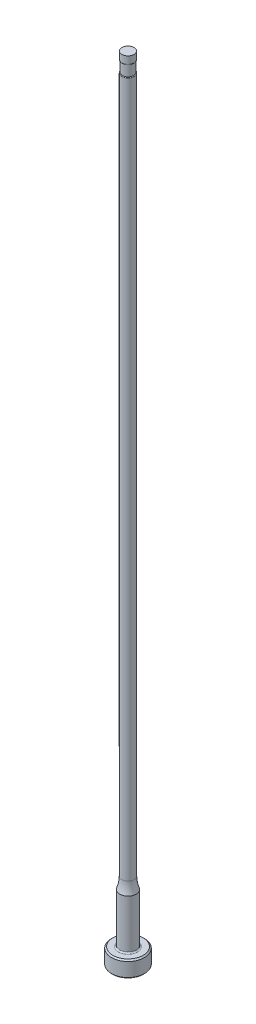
ISO-10303-21;
HEADER;
FILE_DESCRIPTION(('STEP AP214'),'2;1');
FILE_NAME('part.step','',(''),(''),'','','');
FILE_SCHEMA(('AUTOMOTIVE_DESIGN { 1 0 10303 214 1 1 1 1 }'));
ENDSEC;
DATA;
#1=APPLICATION_CONTEXT('core data for automotive mechanical design processes');
#2=APPLICATION_PROTOCOL_DEFINITION('international standard','automotive_design',2000,#1);
#3=PRODUCT_CONTEXT('',#1,'mechanical');
#4=PRODUCT('Part','Part','',(#3));
#5=PRODUCT_RELATED_PRODUCT_CATEGORY('part','',(#4));
#6=PRODUCT_DEFINITION_FORMATION('','',#4);
#7=PRODUCT_DEFINITION_CONTEXT('part definition',#1,'design');
#8=PRODUCT_DEFINITION('design','',#6,#7);
#9=PRODUCT_DEFINITION_SHAPE('','',#8);
#10=(LENGTH_UNIT() NAMED_UNIT(*) SI_UNIT(.MILLI.,.METRE.));
#11=(NAMED_UNIT(*) PLANE_ANGLE_UNIT() SI_UNIT($,.RADIAN.));
#12=(NAMED_UNIT(*) SI_UNIT($,.STERADIAN.) SOLID_ANGLE_UNIT());
#13=UNCERTAINTY_MEASURE_WITH_UNIT(LENGTH_MEASURE(1.E-05),#10,'distance_accuracy_value','');
#14=(GEOMETRIC_REPRESENTATION_CONTEXT(3) GLOBAL_UNCERTAINTY_ASSIGNED_CONTEXT((#13)) GLOBAL_UNIT_ASSIGNED_CONTEXT((#10,
#11,#12)) REPRESENTATION_CONTEXT('',''));
#15=CARTESIAN_POINT('',(0.,0.,0.));
#16=DIRECTION('',(0.,0.,1.));
#17=DIRECTION('',(1.,0.,0.));
#18=AXIS2_PLACEMENT_3D('',#15,#16,#17);
#19=CARTESIAN_POINT('',(0.,259.958771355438,0.));
#20=DIRECTION('',(0.,1.,0.));
#21=DIRECTION('',(0.,0.,1.));
#22=AXIS2_PLACEMENT_3D('',#19,#20,#21);
#23=CYLINDRICAL_SURFACE('',#22,1.18998999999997);
#24=DIRECTION('',(0.,1.,0.));
#25=VECTOR('',#24,1.);
#26=CARTESIAN_POINT('',(-1.08838999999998,259.958771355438,-0.481127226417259));
#27=LINE('',#26,#25);
#28=CARTESIAN_POINT('',(-1.08838999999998,148.719565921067,-0.481127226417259));
#29=VERTEX_POINT('',#28);
#30=CARTESIAN_POINT('',(-1.08838999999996,111.76,-0.481127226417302));
#31=VERTEX_POINT('',#30);
#32=EDGE_CURVE('E66',#29,#31,#27,.F.);
#33=ORIENTED_EDGE('',*,*,#32,.F.);
#34=CARTESIAN_POINT('',(0.,148.719565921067,0.));
#35=DIRECTION('',(0.,1.,0.));
#36=DIRECTION('',(0.,0.,1.));
#37=AXIS2_PLACEMENT_3D('',#34,#35,#36);
#38=CIRCLE('',#37,1.18998999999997);
#39=CARTESIAN_POINT('',(-1.08838999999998,148.719565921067,0.481127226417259));
#40=VERTEX_POINT('',#39);
#41=EDGE_CURVE('E44',#29,#40,#38,.F.);
#42=ORIENTED_EDGE('',*,*,#41,.T.);
#43=DIRECTION('',(0.,1.,0.));
#44=VECTOR('',#43,1.);
#45=CARTESIAN_POINT('',(-1.08838999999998,259.958771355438,0.481127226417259));
#46=LINE('',#45,#44);
#47=CARTESIAN_POINT('',(-1.08838999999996,111.76,0.481127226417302));
#48=VERTEX_POINT('',#47);
#49=EDGE_CURVE('E72',#48,#40,#46,.T.);
#50=ORIENTED_EDGE('',*,*,#49,.F.);
#51=CARTESIAN_POINT('',(-1.08838999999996,111.76,-0.481127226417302));
#52=CARTESIAN_POINT('',(-1.08838966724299,111.731183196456,-0.481120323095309));
#53=CARTESIAN_POINT('',(-1.08878297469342,111.702379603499,-0.480240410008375));
#54=CARTESIAN_POINT('',(-1.0903471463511,111.64487486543,-0.476680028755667));
#55=CARTESIAN_POINT('',(-1.09151883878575,111.616173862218,-0.473997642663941));
#56=CARTESIAN_POINT('',(-1.0962236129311,111.529732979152,-0.463079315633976));
#57=CARTESIAN_POINT('',(-1.10094613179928,111.472365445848,-0.451969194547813));
#58=CARTESIAN_POINT('',(-1.11171709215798,111.373397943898,-0.424640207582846));
#59=CARTESIAN_POINT('',(-1.11720060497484,111.331237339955,-0.41021369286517));
#60=CARTESIAN_POINT('',(-1.12939077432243,111.24975729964,-0.375363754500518));
#61=CARTESIAN_POINT('',(-1.13609165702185,111.21042562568,-0.354968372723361));
#62=CARTESIAN_POINT('',(-1.1472645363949,111.150969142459,-0.316366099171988));
#63=CARTESIAN_POINT('',(-1.15158336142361,111.129348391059,-0.300422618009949));
#64=CARTESIAN_POINT('',(-1.16012072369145,111.088602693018,-0.265553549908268));
#65=CARTESIAN_POINT('',(-1.16433935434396,111.069475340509,-0.246630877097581));
#66=CARTESIAN_POINT('',(-1.17139417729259,111.038625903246,-0.210179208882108));
#67=CARTESIAN_POINT('',(-1.17432972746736,111.026201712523,-0.193268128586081));
#68=CARTESIAN_POINT('',(-1.17964378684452,111.004180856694,-0.157607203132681));
#69=CARTESIAN_POINT('',(-1.18202305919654,110.994580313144,-0.138859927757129));
#70=CARTESIAN_POINT('',(-1.1856222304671,110.980246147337,-0.103155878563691));
#71=CARTESIAN_POINT('',(-1.1869702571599,110.974963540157,-0.0864338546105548));
#72=CARTESIAN_POINT('',(-1.18896221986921,110.967197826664,-0.05230931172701));
#73=CARTESIAN_POINT('',(-1.18960661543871,110.964712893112,-0.0349072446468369));
#74=CARTESIAN_POINT('',(-1.1901191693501,110.962734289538,0.000122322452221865));
#75=CARTESIAN_POINT('',(-1.18998545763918,110.963247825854,0.0177502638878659));
#76=CARTESIAN_POINT('',(-1.18895328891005,110.967240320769,0.0526432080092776));
#77=CARTESIAN_POINT('',(-1.18805460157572,110.970720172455,0.0699080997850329));
#78=CARTESIAN_POINT('',(-1.18562828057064,110.98023683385,0.103108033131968));
#79=CARTESIAN_POINT('',(-1.18411982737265,110.986195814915,0.11906720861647));
#80=CARTESIAN_POINT('',(-1.18061056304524,111.000296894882,0.149921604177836));
#81=CARTESIAN_POINT('',(-1.17860955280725,111.008439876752,0.164816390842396));
#82=CARTESIAN_POINT('',(-1.17313921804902,111.031184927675,0.200749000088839));
#83=CARTESIAN_POINT('',(-1.1694436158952,111.046956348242,0.221012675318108));
#84=CARTESIAN_POINT('',(-1.16168543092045,111.081494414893,0.258718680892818));
#85=CARTESIAN_POINT('',(-1.15762196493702,111.100268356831,0.276153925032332));
#86=CARTESIAN_POINT('',(-1.14734460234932,111.150227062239,0.316729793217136));
#87=CARTESIAN_POINT('',(-1.14110751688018,111.182801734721,0.338145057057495));
#88=CARTESIAN_POINT('',(-1.12927494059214,111.250924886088,0.375765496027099));
#89=CARTESIAN_POINT('',(-1.12368108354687,111.28648055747,0.391957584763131));
#90=CARTESIAN_POINT('',(-1.11078204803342,111.379330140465,0.427525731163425));
#91=CARTESIAN_POINT('',(-1.10420802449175,111.437901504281,0.443819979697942));
#92=CARTESIAN_POINT('',(-1.09432365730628,111.556957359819,0.467642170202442));
#93=CARTESIAN_POINT('',(-1.09101219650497,111.617441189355,0.475173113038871));
#94=CARTESIAN_POINT('',(-1.0890934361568,111.691778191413,0.479532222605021));
#95=CARTESIAN_POINT('',(-1.08882945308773,111.705431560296,0.480131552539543));
#96=CARTESIAN_POINT('',(-1.08847803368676,111.732722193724,0.480928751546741));
#97=CARTESIAN_POINT('',(-1.08839020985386,111.746359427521,0.481127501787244));
#98=CARTESIAN_POINT('',(-1.08838999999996,111.76,0.481127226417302));
#99=B_SPLINE_CURVE_WITH_KNOTS('',3,(#51,#52,#53,#54,#55,#56,#57,#58,#59,#60,#61,#62,#63,#64,#65,
#66,#67,#68,#69,#70,#71,#72,#73,#74,#75,#76,#77,#78,#79,#80,#81,#82,#83,#84,#85,#86,#87,#88,#89,
#90,#91,#92,#93,#94,#95,#96,#97,#98),.UNSPECIFIED.,.F.,.F.,(4,2,2,2,2,2,2,2,2,2,2,2,2,2,2,2,2,2,
2,2,2,2,2,4),(0.,0.0864065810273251,0.172905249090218,0.348016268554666,0.48234589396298,
0.616054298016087,0.697472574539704,0.778811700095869,0.842154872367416,0.905410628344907,
0.957949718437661,1.01045447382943,1.0630854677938,1.11573231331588,1.16683808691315,
1.21796455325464,1.29535063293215,1.37292769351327,1.49070506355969,1.60877526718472,
1.79125586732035,1.9736739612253,2.01467753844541,2.05559081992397),.UNSPECIFIED.);
#100=EDGE_CURVE('E74',#31,#48,#99,.T.);
#101=ORIENTED_EDGE('',*,*,#100,.F.);
#102=EDGE_LOOP('',(#33,#42,#50,#101));
#103=FACE_BOUND('',#102,.T.);
#104=CARTESIAN_POINT('',(0.,14.9114164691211,0.));
#105=DIRECTION('',(0.,1.,0.));
#106=DIRECTION('',(0.,0.,1.));
#107=AXIS2_PLACEMENT_3D('',#104,#105,#106);
#108=CIRCLE('',#107,1.18998999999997);
#109=CARTESIAN_POINT('',(0.,14.9114164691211,1.18998999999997));
#110=VERTEX_POINT('',#109);
#111=EDGE_CURVE('E95',#110,#110,#108,.T.);
#112=ORIENTED_EDGE('',*,*,#111,.T.);
#113=EDGE_LOOP('',(#112));
#114=FACE_BOUND('',#113,.T.);
#115=ADVANCED_FACE('F36',(#103,#114),#23,.T.);
#116=CARTESIAN_POINT('',(0.,14.9114164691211,0.));
#117=DIRECTION('',(0.,1.,0.));
#118=DIRECTION('',(0.,0.,1.));
#119=AXIS2_PLACEMENT_3D('',#116,#117,#118);
#120=TOROIDAL_SURFACE('',#119,7.53998999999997,6.35);
#121=CARTESIAN_POINT('',(0.,12.7,0.));
#122=DIRECTION('',(0.,1.,0.));
#123=DIRECTION('',(0.,0.,1.));
#124=AXIS2_PLACEMENT_3D('',#121,#122,#123);
#125=CIRCLE('',#124,1.58749999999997);
#126=CARTESIAN_POINT('',(0.,12.7,1.58749999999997));
#127=VERTEX_POINT('',#126);
#128=EDGE_CURVE('E92',#127,#127,#125,.T.);
#129=ORIENTED_EDGE('',*,*,#128,.T.);
#130=EDGE_LOOP('',(#129));
#131=FACE_BOUND('',#130,.T.);
#132=ORIENTED_EDGE('',*,*,#111,.F.);
#133=EDGE_LOOP('',(#132));
#134=FACE_BOUND('',#133,.T.);
#135=ADVANCED_FACE('F156',(#131,#134),#120,.F.);
#136=CARTESIAN_POINT('',(0.,259.958771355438,0.));
#137=DIRECTION('',(0.,1.,0.));
#138=DIRECTION('',(0.,0.,1.));
#139=AXIS2_PLACEMENT_3D('',#136,#137,#138);
#140=CYLINDRICAL_SURFACE('',#139,1.58749999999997);
#141=CARTESIAN_POINT('',(0.,3.42900000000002,0.));
#142=DIRECTION('',(0.,1.,0.));
#143=DIRECTION('',(0.,0.,1.));
#144=AXIS2_PLACEMENT_3D('',#141,#142,#143);
#145=CIRCLE('',#144,1.58749999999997);
#146=CARTESIAN_POINT('',(0.,3.42900000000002,1.58749999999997));
#147=VERTEX_POINT('',#146);
#148=EDGE_CURVE('E110',#147,#147,#145,.T.);
#149=ORIENTED_EDGE('',*,*,#148,.T.);
#150=EDGE_LOOP('',(#149));
#151=FACE_BOUND('',#150,.T.);
#152=ORIENTED_EDGE('',*,*,#128,.F.);
#153=EDGE_LOOP('',(#152));
#154=FACE_BOUND('',#153,.T.);
#155=ADVANCED_FACE('F153',(#151,#154),#140,.T.);
#156=CARTESIAN_POINT('',(-3.17499999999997,3.175,0.));
#157=DIRECTION('',(0.,1.,0.));
#158=DIRECTION('',(0.,0.,1.));
#159=AXIS2_PLACEMENT_3D('',#156,#157,#158);
#160=PLANE('',#159);
#161=CARTESIAN_POINT('',(0.,3.175,0.));
#162=DIRECTION('',(0.,1.,0.));
#163=DIRECTION('',(0.,0.,1.));
#164=AXIS2_PLACEMENT_3D('',#161,#162,#163);
#165=CIRCLE('',#164,1.84149999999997);
#166=CARTESIAN_POINT('',(0.,3.175,1.84149999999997));
#167=VERTEX_POINT('',#166);
#168=EDGE_CURVE('E78',#167,#167,#165,.F.);
#169=ORIENTED_EDGE('',*,*,#168,.T.);
#170=EDGE_LOOP('',(#169));
#171=FACE_BOUND('',#170,.T.);
#172=CARTESIAN_POINT('',(0.,3.175,0.));
#173=DIRECTION('',(0.,1.,0.));
#174=DIRECTION('',(0.,0.,1.));
#175=AXIS2_PLACEMENT_3D('',#172,#173,#174);
#176=CIRCLE('',#175,2.92099999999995);
#177=CARTESIAN_POINT('',(0.,3.175,2.92099999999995));
#178=VERTEX_POINT('',#177);
#179=EDGE_CURVE('E98',#178,#178,#176,.T.);
#180=ORIENTED_EDGE('',*,*,#179,.T.);
#181=EDGE_LOOP('',(#180));
#182=FACE_BOUND('',#181,.T.);
#183=ADVANCED_FACE('F149',(#171,#182),#160,.T.);
#184=CARTESIAN_POINT('',(0.,259.958771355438,0.));
#185=DIRECTION('',(0.,1.,0.));
#186=DIRECTION('',(0.,0.,1.));
#187=AXIS2_PLACEMENT_3D('',#184,#185,#186);
#188=CYLINDRICAL_SURFACE('',#187,3.17499999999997);
#189=CARTESIAN_POINT('',(0.,2.92100000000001,0.));
#190=DIRECTION('',(0.,1.,0.));
#191=DIRECTION('',(0.,0.,1.));
#192=AXIS2_PLACEMENT_3D('',#189,#190,#191);
#193=CIRCLE('',#192,3.17499999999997);
#194=CARTESIAN_POINT('',(0.,2.92100000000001,3.17499999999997));
#195=VERTEX_POINT('',#194);
#196=EDGE_CURVE('E104',#195,#195,#193,.F.);
#197=ORIENTED_EDGE('',*,*,#196,.T.);
#198=EDGE_LOOP('',(#197));
#199=FACE_BOUND('',#198,.T.);
#200=CARTESIAN_POINT('',(0.,0.254000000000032,0.));
#201=DIRECTION('',(0.,-1.,0.));
#202=DIRECTION('',(0.,0.,-1.));
#203=AXIS2_PLACEMENT_3D('',#200,#201,#202);
#204=CIRCLE('',#203,3.17499999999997);
#205=CARTESIAN_POINT('',(0.,0.254000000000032,-3.17499999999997));
#206=VERTEX_POINT('',#205);
#207=EDGE_CURVE('E101',#206,#206,#204,.F.);
#208=ORIENTED_EDGE('',*,*,#207,.T.);
#209=EDGE_LOOP('',(#208));
#210=FACE_BOUND('',#209,.T.);
#211=ADVANCED_FACE('F145',(#199,#210),#188,.T.);
#212=CARTESIAN_POINT('',(0.,0.,0.));
#213=DIRECTION('',(0.,-1.,0.));
#214=DIRECTION('',(0.,0.,-1.));
#215=AXIS2_PLACEMENT_3D('',#212,#213,#214);
#216=PLANE('',#215);
#217=CARTESIAN_POINT('',(0.,0.,0.));
#218=DIRECTION('',(0.,-1.,0.));
#219=DIRECTION('',(0.,0.,-1.));
#220=AXIS2_PLACEMENT_3D('',#217,#218,#219);
#221=CIRCLE('',#220,2.92099999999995);
#222=CARTESIAN_POINT('',(0.,0.,-2.92099999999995));
#223=VERTEX_POINT('',#222);
#224=EDGE_CURVE('E107',#223,#223,#221,.T.);
#225=ORIENTED_EDGE('',*,*,#224,.T.);
#226=EDGE_LOOP('',(#225));
#227=FACE_BOUND('',#226,.T.);
#228=ADVANCED_FACE('F141',(#227),#216,.T.);
#229=CARTESIAN_POINT('',(0.,3.17499999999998,0.));
#230=DIRECTION('',(0.,-1.,0.));
#231=DIRECTION('',(0.,0.,-1.));
#232=AXIS2_PLACEMENT_3D('',#229,#230,#231);
#233=CONICAL_SURFACE('',#232,2.92099999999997,0.7853981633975);
#234=ORIENTED_EDGE('',*,*,#196,.F.);
#235=EDGE_LOOP('',(#234));
#236=FACE_BOUND('',#235,.T.);
#237=ORIENTED_EDGE('',*,*,#179,.F.);
#238=EDGE_LOOP('',(#237));
#239=FACE_BOUND('',#238,.T.);
#240=ADVANCED_FACE('F144',(#236,#239),#233,.T.);
#241=CARTESIAN_POINT('',(0.,0.254000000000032,0.));
#242=DIRECTION('',(0.,1.,0.));
#243=DIRECTION('',(0.,0.,1.));
#244=AXIS2_PLACEMENT_3D('',#241,#242,#243);
#245=CONICAL_SURFACE('',#244,3.17499999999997,0.785398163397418);
#246=ORIENTED_EDGE('',*,*,#224,.F.);
#247=EDGE_LOOP('',(#246));
#248=FACE_BOUND('',#247,.T.);
#249=ORIENTED_EDGE('',*,*,#207,.F.);
#250=EDGE_LOOP('',(#249));
#251=FACE_BOUND('',#250,.T.);
#252=ADVANCED_FACE('F245',(#248,#251),#245,.T.);
#253=CARTESIAN_POINT('',(0.,3.42900000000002,0.));
#254=DIRECTION('',(0.,1.,0.));
#255=DIRECTION('',(0.,0.,1.));
#256=AXIS2_PLACEMENT_3D('',#253,#254,#255);
#257=TOROIDAL_SURFACE('',#256,1.84149999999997,0.254);
#258=ORIENTED_EDGE('',*,*,#168,.F.);
#259=EDGE_LOOP('',(#258));
#260=FACE_BOUND('',#259,.T.);
#261=ORIENTED_EDGE('',*,*,#148,.F.);
#262=EDGE_LOOP('',(#261));
#263=FACE_BOUND('',#262,.T.);
#264=ADVANCED_FACE('F139',(#260,#263),#257,.F.);
#265=CARTESIAN_POINT('',(0.,153.448281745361,0.));
#266=DIRECTION('',(0.,1.,0.));
#267=DIRECTION('',(0.,0.,1.));
#268=AXIS2_PLACEMENT_3D('',#265,#266,#267);
#269=CYLINDRICAL_SURFACE('',#268,1.08838999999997);
#270=CARTESIAN_POINT('',(0.,150.876,0.));
#271=DIRECTION('',(0.,1.,0.));
#272=DIRECTION('',(0.,0.,1.));
#273=AXIS2_PLACEMENT_3D('',#270,#271,#272);
#274=CIRCLE('',#273,1.08838999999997);
#275=CARTESIAN_POINT('',(0.,150.876,1.08838999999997));
#276=VERTEX_POINT('',#275);
#277=EDGE_CURVE('E71',#276,#276,#274,.T.);
#278=ORIENTED_EDGE('',*,*,#277,.F.);
#279=EDGE_LOOP('',(#278));
#280=FACE_BOUND('',#279,.T.);
#281=CARTESIAN_POINT('',(0.,148.844,0.));
#282=DIRECTION('',(0.,1.,0.));
#283=DIRECTION('',(0.,0.,1.));
#284=AXIS2_PLACEMENT_3D('',#281,#282,#283);
#285=CIRCLE('',#284,1.08838999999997);
#286=CARTESIAN_POINT('',(-1.08838999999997,148.844,0.));
#287=VERTEX_POINT('',#286);
#288=EDGE_CURVE('E89',#287,#287,#285,.T.);
#289=ORIENTED_EDGE('',*,*,#288,.T.);
#290=EDGE_LOOP('',(#289));
#291=FACE_BOUND('',#290,.T.);
#292=ADVANCED_FACE('F136',(#280,#291),#269,.T.);
#293=CARTESIAN_POINT('',(-1.08838999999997,149.86,-3.17499999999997));
#294=DIRECTION('',(1.,0.,0.));
#295=DIRECTION('',(0.,1.,0.));
#296=AXIS2_PLACEMENT_3D('',#293,#294,#295);
#297=PLANE('',#296);
#298=CARTESIAN_POINT('',(-1.08838999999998,148.719565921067,0.481127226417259));
#299=CARTESIAN_POINT('',(-1.08838999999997,148.722730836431,0.481135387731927));
#300=CARTESIAN_POINT('',(-1.08838999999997,148.725885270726,0.480835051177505));
#301=CARTESIAN_POINT('',(-1.08838999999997,148.73205903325,0.479692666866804));
#302=CARTESIAN_POINT('',(-1.08838999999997,148.735079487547,0.478856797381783));
#303=CARTESIAN_POINT('',(-1.08838999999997,148.741599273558,0.476477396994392));
#304=CARTESIAN_POINT('',(-1.08838999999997,148.745055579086,0.474817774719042));
#305=CARTESIAN_POINT('',(-1.08838999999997,148.75166384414,0.470958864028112));
#306=CARTESIAN_POINT('',(-1.08838999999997,148.754814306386,0.468757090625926));
#307=CARTESIAN_POINT('',(-1.08838999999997,148.762477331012,0.462614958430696));
#308=CARTESIAN_POINT('',(-1.08838999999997,148.766761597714,0.45839250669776));
#309=CARTESIAN_POINT('',(-1.08838999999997,148.774655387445,0.449369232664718));
#310=CARTESIAN_POINT('',(-1.08838999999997,148.778263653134,0.444567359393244));
#311=CARTESIAN_POINT('',(-1.08838999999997,148.788137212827,0.429819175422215));
#312=CARTESIAN_POINT('',(-1.08838999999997,148.793627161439,0.419360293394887));
#313=CARTESIAN_POINT('',(-1.08838999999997,148.803180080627,0.397821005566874));
#314=CARTESIAN_POINT('',(-1.08838999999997,148.807238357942,0.386738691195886));
#315=CARTESIAN_POINT('',(-1.08838999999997,148.818260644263,0.351899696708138));
#316=CARTESIAN_POINT('',(-1.08838999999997,148.823509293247,0.327613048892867));
#317=CARTESIAN_POINT('',(-1.08838999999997,148.831621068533,0.278627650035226));
#318=CARTESIAN_POINT('',(-1.08838999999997,148.834474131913,0.253927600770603));
#319=CARTESIAN_POINT('',(-1.08838999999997,148.838780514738,0.204271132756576));
#320=CARTESIAN_POINT('',(-1.08838999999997,148.84022603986,0.179314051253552));
#321=CARTESIAN_POINT('',(-1.08838999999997,148.842315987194,0.129366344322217));
#322=CARTESIAN_POINT('',(-1.08838999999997,148.842960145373,0.10437571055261));
#323=CARTESIAN_POINT('',(-1.08838999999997,148.843594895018,0.0661077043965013));
#324=CARTESIAN_POINT('',(-1.08838999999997,148.843750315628,0.052832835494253));
#325=CARTESIAN_POINT('',(-1.08838999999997,148.843951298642,0.0263719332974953));
#326=CARTESIAN_POINT('',(-1.08838999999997,148.843997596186,0.0131859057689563));
#327=CARTESIAN_POINT('',(-1.08838999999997,148.844,0.));
#328=B_SPLINE_CURVE_WITH_KNOTS('',3,(#298,#299,#300,#301,#302,#303,#304,#305,#306,#307,#308,
#309,#310,#311,#312,#313,#314,#315,#316,#317,#318,#319,#320,#321,#322,#323,#324,#325,#326,#327),
.UNSPECIFIED.,.F.,.F.,(4,2,2,2,2,2,2,2,2,2,2,2,2,2,4),(0.,0.00946358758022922,
0.0188199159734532,0.0302585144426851,0.0417505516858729,0.0596944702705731,0.0776714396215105,
0.112909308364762,0.148261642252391,0.222508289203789,0.297065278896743,0.372032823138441,
0.447025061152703,0.486851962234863,0.526409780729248),.UNSPECIFIED.);
#329=EDGE_CURVE('E77',#40,#287,#328,.T.);
#330=ORIENTED_EDGE('',*,*,#329,.T.);
#331=CARTESIAN_POINT('',(-1.08838999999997,148.844,0.));
#332=CARTESIAN_POINT('',(-1.08838999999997,148.843979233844,-0.021171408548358));
#333=CARTESIAN_POINT('',(-1.08838999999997,148.843872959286,-0.0423450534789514));
#334=CARTESIAN_POINT('',(-1.08838999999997,148.843341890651,-0.0847174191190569));
#335=CARTESIAN_POINT('',(-1.08838999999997,148.842916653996,-0.105916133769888));
#336=CARTESIAN_POINT('',(-1.08838999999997,148.841599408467,-0.148299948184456));
#337=CARTESIAN_POINT('',(-1.08838999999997,148.840707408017,-0.169485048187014));
#338=CARTESIAN_POINT('',(-1.08838999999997,148.838153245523,-0.211801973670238));
#339=CARTESIAN_POINT('',(-1.08838999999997,148.836491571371,-0.23293382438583));
#340=CARTESIAN_POINT('',(-1.08838999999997,148.8327838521,-0.267143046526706));
#341=CARTESIAN_POINT('',(-1.08838999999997,148.831117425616,-0.280260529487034));
#342=CARTESIAN_POINT('',(-1.08838999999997,148.827125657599,-0.306428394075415));
#343=CARTESIAN_POINT('',(-1.08838999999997,148.824798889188,-0.319478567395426));
#344=CARTESIAN_POINT('',(-1.08838999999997,148.818882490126,-0.347140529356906));
#345=CARTESIAN_POINT('',(-1.08838999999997,148.815164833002,-0.361725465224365));
#346=CARTESIAN_POINT('',(-1.08838999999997,148.806079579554,-0.390359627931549));
#347=CARTESIAN_POINT('',(-1.08838999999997,148.800719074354,-0.404410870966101));
#348=CARTESIAN_POINT('',(-1.08838999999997,148.791612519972,-0.422803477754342));
#349=CARTESIAN_POINT('',(-1.08838999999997,148.78897440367,-0.42768908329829));
#350=CARTESIAN_POINT('',(-1.08838999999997,148.783260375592,-0.437212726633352));
#351=CARTESIAN_POINT('',(-1.08838999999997,148.780183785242,-0.441850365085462));
#352=CARTESIAN_POINT('',(-1.08838999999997,148.773476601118,-0.450784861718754));
#353=CARTESIAN_POINT('',(-1.08838999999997,148.769840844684,-0.455077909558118));
#354=CARTESIAN_POINT('',(-1.08838999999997,148.761937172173,-0.463042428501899));
#355=CARTESIAN_POINT('',(-1.08838999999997,148.757671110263,-0.466715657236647));
#356=CARTESIAN_POINT('',(-1.08838999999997,148.750303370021,-0.47179758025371));
#357=CARTESIAN_POINT('',(-1.08838999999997,148.747421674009,-0.473523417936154));
#358=CARTESIAN_POINT('',(-1.08838999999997,148.741432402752,-0.476511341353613));
#359=CARTESIAN_POINT('',(-1.08838999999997,148.738325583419,-0.47777490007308));
#360=CARTESIAN_POINT('',(-1.08838999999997,148.732621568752,-0.479523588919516));
#361=CARTESIAN_POINT('',(-1.08838999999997,148.730057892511,-0.480117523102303));
#362=CARTESIAN_POINT('',(-1.08838999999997,148.724853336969,-0.48092285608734));
#363=CARTESIAN_POINT('',(-1.08838999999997,148.722212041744,-0.481131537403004));
#364=CARTESIAN_POINT('',(-1.08838999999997,148.719565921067,-0.481127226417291));
#365=B_SPLINE_CURVE_WITH_KNOTS('',3,(#331,#332,#333,#334,#335,#336,#337,#338,#339,#340,#341,
#342,#343,#344,#345,#346,#347,#348,#349,#350,#351,#352,#353,#354,#355,#356,#357,#358,#359,#360,
#361,#362,#363,#364),.UNSPECIFIED.,.F.,.F.,(4,2,2,2,2,2,2,2,2,2,2,2,2,2,2,2,4),(0.,
0.0635177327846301,0.127123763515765,0.190728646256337,0.254293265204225,0.293950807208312,
0.333694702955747,0.378800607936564,0.423714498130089,0.44035488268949,0.457021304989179,
0.473852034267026,0.490634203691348,0.500679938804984,0.510693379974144,0.518560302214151,
0.52648250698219),.UNSPECIFIED.);
#366=EDGE_CURVE('E58',#287,#29,#365,.T.);
#367=ORIENTED_EDGE('',*,*,#366,.T.);
#368=ORIENTED_EDGE('',*,*,#32,.T.);
#369=DIRECTION('',(0.,0.,1.));
#370=VECTOR('',#369,1.);
#371=CARTESIAN_POINT('',(-1.08838999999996,111.76,-3.17499999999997));
#372=LINE('',#371,#370);
#373=EDGE_CURVE('E70',#31,#48,#372,.T.);
#374=ORIENTED_EDGE('',*,*,#373,.T.);
#375=ORIENTED_EDGE('',*,*,#49,.T.);
#376=EDGE_LOOP('',(#330,#367,#368,#374,#375));
#377=FACE_BOUND('',#376,.T.);
#378=ADVANCED_FACE('F68',(#377),#297,.F.);
#379=CARTESIAN_POINT('',(-4.26338999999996,111.76,-3.17499999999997));
#380=DIRECTION('',(0.,0.,1.));
#381=DIRECTION('',(1.,0.,0.));
#382=AXIS2_PLACEMENT_3D('',#379,#380,#381);
#383=CYLINDRICAL_SURFACE('',#382,3.175);
#384=ORIENTED_EDGE('',*,*,#373,.F.);
#385=ORIENTED_EDGE('',*,*,#100,.T.);
#386=EDGE_LOOP('',(#384,#385));
#387=FACE_BOUND('',#386,.T.);
#388=ADVANCED_FACE('F80',(#387),#383,.F.);
#389=CARTESIAN_POINT('',(0.,152.687735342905,0.));
#390=DIRECTION('',(0.,1.,0.));
#391=DIRECTION('',(0.,0.,1.));
#392=AXIS2_PLACEMENT_3D('',#389,#390,#391);
#393=CYLINDRICAL_SURFACE('',#392,1.16458999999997);
#394=CARTESIAN_POINT('',(0.,150.992397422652,0.));
#395=DIRECTION('',(0.,-1.,0.));
#396=DIRECTION('',(0.,0.,-1.));
#397=AXIS2_PLACEMENT_3D('',#394,#395,#396);
#398=CIRCLE('',#397,1.16458999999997);
#399=CARTESIAN_POINT('',(0.,150.992397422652,-1.16458999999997));
#400=VERTEX_POINT('',#399);
#401=EDGE_CURVE('E11',#400,#400,#398,.F.);
#402=ORIENTED_EDGE('',*,*,#401,.T.);
#403=EDGE_LOOP('',(#402));
#404=FACE_BOUND('',#403,.T.);
#405=CARTESIAN_POINT('',(0.,152.4,0.));
#406=DIRECTION('',(0.,1.,0.));
#407=DIRECTION('',(0.,0.,1.));
#408=AXIS2_PLACEMENT_3D('',#405,#406,#407);
#409=CIRCLE('',#408,1.16458999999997);
#410=CARTESIAN_POINT('',(0.,152.4,1.16458999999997));
#411=VERTEX_POINT('',#410);
#412=EDGE_CURVE('E81',#411,#411,#409,.T.);
#413=ORIENTED_EDGE('',*,*,#412,.F.);
#414=EDGE_LOOP('',(#413));
#415=FACE_BOUND('',#414,.T.);
#416=ADVANCED_FACE('F133',(#404,#415),#393,.T.);
#417=CARTESIAN_POINT('',(-1.18998999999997,152.4,0.));
#418=DIRECTION('',(0.,1.,0.));
#419=DIRECTION('',(0.,0.,1.));
#420=AXIS2_PLACEMENT_3D('',#417,#418,#419);
#421=PLANE('',#420);
#422=ORIENTED_EDGE('',*,*,#412,.T.);
#423=EDGE_LOOP('',(#422));
#424=FACE_BOUND('',#423,.T.);
#425=ADVANCED_FACE('F177',(#424),#421,.T.);
#426=CARTESIAN_POINT('',(0.,148.719565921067,0.));
#427=DIRECTION('',(0.,1.,0.));
#428=DIRECTION('',(0.,0.,1.));
#429=AXIS2_PLACEMENT_3D('',#426,#427,#428);
#430=TOROIDAL_SURFACE('',#429,1.06298999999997,0.127);
#431=ORIENTED_EDGE('',*,*,#329,.F.);
#432=ORIENTED_EDGE('',*,*,#41,.F.);
#433=ORIENTED_EDGE('',*,*,#366,.F.);
#434=ORIENTED_EDGE('',*,*,#288,.F.);
#435=EDGE_LOOP('',(#431,#432,#433,#434));
#436=FACE_BOUND('',#435,.T.);
#437=ADVANCED_FACE('F209',(#436),#430,.T.);
#438=CARTESIAN_POINT('',(0.,150.992397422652,0.));
#439=DIRECTION('',(0.,-1.,0.));
#440=DIRECTION('',(0.,0.,-1.));
#441=AXIS2_PLACEMENT_3D('',#438,#439,#440);
#442=TOROIDAL_SURFACE('',#441,1.03758999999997,0.127);
#443=ORIENTED_EDGE('',*,*,#277,.T.);
#444=EDGE_LOOP('',(#443));
#445=FACE_BOUND('',#444,.T.);
#446=ORIENTED_EDGE('',*,*,#401,.F.);
#447=EDGE_LOOP('',(#446));
#448=FACE_BOUND('',#447,.T.);
#449=ADVANCED_FACE('F38',(#445,#448),#442,.T.);
#450=CLOSED_SHELL('',(#115,#135,#155,#183,#211,#228,#240,#252,#264,#292,#378,#388,#416,#425,
#437,#449));
#451=MANIFOLD_SOLID_BREP('B2',#450);
#452=ADVANCED_BREP_SHAPE_REPRESENTATION('',(#18,#451),#14);
#453=SHAPE_DEFINITION_REPRESENTATION(#9,#452);
ENDSEC;
END-ISO-10303-21;
